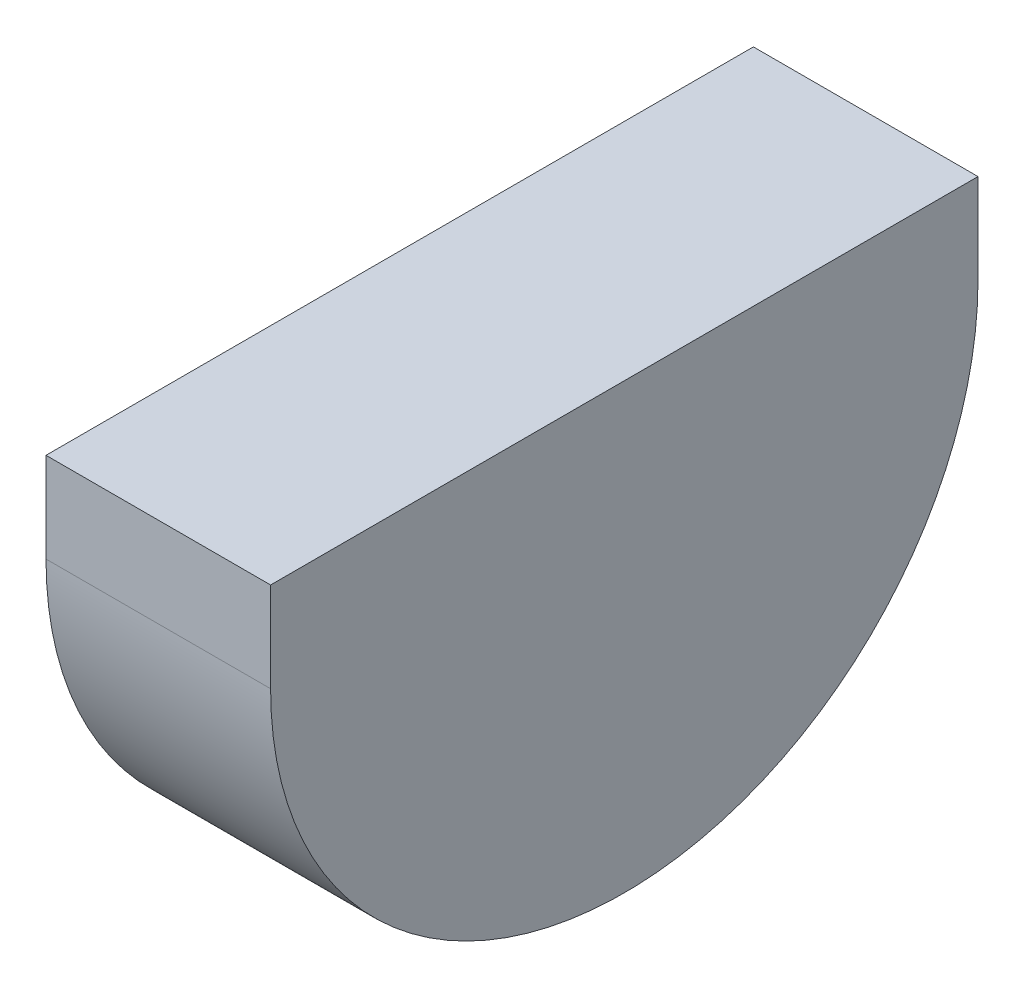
ISO-10303-21;
HEADER;
FILE_DESCRIPTION(('STEP AP214'),'2;1');
FILE_NAME('part.step','',(''),(''),'','','');
FILE_SCHEMA(('AUTOMOTIVE_DESIGN { 1 0 10303 214 1 1 1 1 }'));
ENDSEC;
DATA;
#1=APPLICATION_CONTEXT('core data for automotive mechanical design processes');
#2=APPLICATION_PROTOCOL_DEFINITION('international standard','automotive_design',2000,#1);
#3=PRODUCT_CONTEXT('',#1,'mechanical');
#4=PRODUCT('Part','Part','',(#3));
#5=PRODUCT_RELATED_PRODUCT_CATEGORY('part','',(#4));
#6=PRODUCT_DEFINITION_FORMATION('','',#4);
#7=PRODUCT_DEFINITION_CONTEXT('part definition',#1,'design');
#8=PRODUCT_DEFINITION('design','',#6,#7);
#9=PRODUCT_DEFINITION_SHAPE('','',#8);
#10=(LENGTH_UNIT() NAMED_UNIT(*) SI_UNIT(.MILLI.,.METRE.));
#11=(NAMED_UNIT(*) PLANE_ANGLE_UNIT() SI_UNIT($,.RADIAN.));
#12=(NAMED_UNIT(*) SI_UNIT($,.STERADIAN.) SOLID_ANGLE_UNIT());
#13=UNCERTAINTY_MEASURE_WITH_UNIT(LENGTH_MEASURE(1.E-05),#10,'distance_accuracy_value','');
#14=(GEOMETRIC_REPRESENTATION_CONTEXT(3) GLOBAL_UNCERTAINTY_ASSIGNED_CONTEXT((#13)) GLOBAL_UNIT_ASSIGNED_CONTEXT((#10,
#11,#12)) REPRESENTATION_CONTEXT('',''));
#15=CARTESIAN_POINT('',(0.,0.,0.));
#16=DIRECTION('',(0.,0.,1.));
#17=DIRECTION('',(1.,0.,0.));
#18=AXIS2_PLACEMENT_3D('',#15,#16,#17);
#19=CARTESIAN_POINT('',(1.5875,7.112,24.1046));
#20=DIRECTION('',(-1.,0.,0.));
#21=DIRECTION('',(0.,0.,1.));
#22=AXIS2_PLACEMENT_3D('',#19,#20,#21);
#23=CYLINDRICAL_SURFACE('',#22,5.);
#24=CARTESIAN_POINT('',(-1.5875,7.112,24.1046));
#25=DIRECTION('',(1.,0.,0.));
#26=DIRECTION('',(0.,0.,1.));
#27=AXIS2_PLACEMENT_3D('',#24,#25,#26);
#28=CIRCLE('',#27,5.);
#29=CARTESIAN_POINT('',(-1.5875,7.112,29.1046));
#30=VERTEX_POINT('',#29);
#31=CARTESIAN_POINT('',(-1.5875,7.112,19.1046));
#32=VERTEX_POINT('',#31);
#33=EDGE_CURVE('E71',#30,#32,#28,.T.);
#34=ORIENTED_EDGE('',*,*,#33,.T.);
#35=DIRECTION('',(-1.,0.,0.));
#36=VECTOR('',#35,1.);
#37=CARTESIAN_POINT('',(1.5875,7.112,19.1046));
#38=LINE('',#37,#36);
#39=CARTESIAN_POINT('',(1.5875,7.112,19.1046));
#40=VERTEX_POINT('',#39);
#41=EDGE_CURVE('E11',#40,#32,#38,.T.);
#42=ORIENTED_EDGE('',*,*,#41,.F.);
#43=CARTESIAN_POINT('',(1.5875,7.112,24.1046));
#44=DIRECTION('',(1.,0.,0.));
#45=DIRECTION('',(0.,0.,1.));
#46=AXIS2_PLACEMENT_3D('',#43,#44,#45);
#47=CIRCLE('',#46,5.);
#48=CARTESIAN_POINT('',(1.5875,7.112,29.1046));
#49=VERTEX_POINT('',#48);
#50=EDGE_CURVE('E45',#49,#40,#47,.T.);
#51=ORIENTED_EDGE('',*,*,#50,.F.);
#52=DIRECTION('',(-1.,0.,0.));
#53=VECTOR('',#52,1.);
#54=CARTESIAN_POINT('',(1.5875,7.112,29.1046));
#55=LINE('',#54,#53);
#56=EDGE_CURVE('E38',#49,#30,#55,.T.);
#57=ORIENTED_EDGE('',*,*,#56,.T.);
#58=EDGE_LOOP('',(#34,#42,#51,#57));
#59=FACE_BOUND('',#58,.T.);
#60=ADVANCED_FACE('F31',(#59),#23,.T.);
#61=CARTESIAN_POINT('',(1.5875,7.112,24.1046));
#62=DIRECTION('',(-1.,0.,0.));
#63=DIRECTION('',(0.,0.,1.));
#64=AXIS2_PLACEMENT_3D('',#61,#62,#63);
#65=PLANE('',#64);
#66=ORIENTED_EDGE('',*,*,#50,.T.);
#67=DIRECTION('',(0.,-1.,0.));
#68=VECTOR('',#67,1.);
#69=CARTESIAN_POINT('',(1.5875,8.382,19.1046));
#70=LINE('',#69,#68);
#71=CARTESIAN_POINT('',(1.5875,8.382,19.1046));
#72=VERTEX_POINT('',#71);
#73=EDGE_CURVE('E86',#72,#40,#70,.T.);
#74=ORIENTED_EDGE('',*,*,#73,.F.);
#75=DIRECTION('',(0.,0.,-1.));
#76=VECTOR('',#75,1.);
#77=CARTESIAN_POINT('',(1.5875,8.382,29.1046));
#78=LINE('',#77,#76);
#79=CARTESIAN_POINT('',(1.5875,8.382,29.1046));
#80=VERTEX_POINT('',#79);
#81=EDGE_CURVE('E92',#80,#72,#78,.T.);
#82=ORIENTED_EDGE('',*,*,#81,.F.);
#83=DIRECTION('',(0.,-1.,0.));
#84=VECTOR('',#83,1.);
#85=CARTESIAN_POINT('',(1.5875,8.382,29.1046));
#86=LINE('',#85,#84);
#87=EDGE_CURVE('E83',#80,#49,#86,.T.);
#88=ORIENTED_EDGE('',*,*,#87,.T.);
#89=EDGE_LOOP('',(#66,#74,#82,#88));
#90=FACE_BOUND('',#89,.T.);
#91=ADVANCED_FACE('F105',(#90),#65,.F.);
#92=CARTESIAN_POINT('',(-1.5875,7.112,24.1046));
#93=DIRECTION('',(-1.,0.,0.));
#94=DIRECTION('',(0.,0.,1.));
#95=AXIS2_PLACEMENT_3D('',#92,#93,#94);
#96=PLANE('',#95);
#97=ORIENTED_EDGE('',*,*,#33,.F.);
#98=DIRECTION('',(0.,-1.,0.));
#99=VECTOR('',#98,1.);
#100=CARTESIAN_POINT('',(-1.5875,8.382,29.1046));
#101=LINE('',#100,#99);
#102=CARTESIAN_POINT('',(-1.5875,8.382,29.1046));
#103=VERTEX_POINT('',#102);
#104=EDGE_CURVE('E74',#103,#30,#101,.T.);
#105=ORIENTED_EDGE('',*,*,#104,.F.);
#106=DIRECTION('',(0.,0.,1.));
#107=VECTOR('',#106,1.);
#108=CARTESIAN_POINT('',(-1.5875,8.382,19.1046));
#109=LINE('',#108,#107);
#110=CARTESIAN_POINT('',(-1.5875,8.382,19.1046));
#111=VERTEX_POINT('',#110);
#112=EDGE_CURVE('E95',#111,#103,#109,.T.);
#113=ORIENTED_EDGE('',*,*,#112,.F.);
#114=DIRECTION('',(0.,-1.,0.));
#115=VECTOR('',#114,1.);
#116=CARTESIAN_POINT('',(-1.5875,8.382,19.1046));
#117=LINE('',#116,#115);
#118=EDGE_CURVE('E77',#111,#32,#117,.T.);
#119=ORIENTED_EDGE('',*,*,#118,.T.);
#120=EDGE_LOOP('',(#97,#105,#113,#119));
#121=FACE_BOUND('',#120,.T.);
#122=ADVANCED_FACE('F72',(#121),#96,.T.);
#123=CARTESIAN_POINT('',(1.5875,8.382,19.1046));
#124=DIRECTION('',(0.,0.,1.));
#125=DIRECTION('',(1.,0.,0.));
#126=AXIS2_PLACEMENT_3D('',#123,#124,#125);
#127=PLANE('',#126);
#128=ORIENTED_EDGE('',*,*,#41,.T.);
#129=ORIENTED_EDGE('',*,*,#118,.F.);
#130=DIRECTION('',(-1.,0.,0.));
#131=VECTOR('',#130,1.);
#132=CARTESIAN_POINT('',(1.5875,8.382,19.1046));
#133=LINE('',#132,#131);
#134=EDGE_CURVE('E97',#72,#111,#133,.T.);
#135=ORIENTED_EDGE('',*,*,#134,.F.);
#136=ORIENTED_EDGE('',*,*,#73,.T.);
#137=EDGE_LOOP('',(#128,#129,#135,#136));
#138=FACE_BOUND('',#137,.T.);
#139=ADVANCED_FACE('F104',(#138),#127,.F.);
#140=CARTESIAN_POINT('',(-1.5875,8.382,29.1046));
#141=DIRECTION('',(0.,0.,-1.));
#142=DIRECTION('',(-1.,0.,0.));
#143=AXIS2_PLACEMENT_3D('',#140,#141,#142);
#144=PLANE('',#143);
#145=ORIENTED_EDGE('',*,*,#56,.F.);
#146=ORIENTED_EDGE('',*,*,#87,.F.);
#147=DIRECTION('',(1.,0.,0.));
#148=VECTOR('',#147,1.);
#149=CARTESIAN_POINT('',(-1.5875,8.382,29.1046));
#150=LINE('',#149,#148);
#151=EDGE_CURVE('E82',#103,#80,#150,.T.);
#152=ORIENTED_EDGE('',*,*,#151,.F.);
#153=ORIENTED_EDGE('',*,*,#104,.T.);
#154=EDGE_LOOP('',(#145,#146,#152,#153));
#155=FACE_BOUND('',#154,.T.);
#156=ADVANCED_FACE('F81',(#155),#144,.F.);
#157=CARTESIAN_POINT('',(-1.5875,8.382,19.1046));
#158=DIRECTION('',(0.,1.,0.));
#159=DIRECTION('',(0.,0.,1.));
#160=AXIS2_PLACEMENT_3D('',#157,#158,#159);
#161=PLANE('',#160);
#162=ORIENTED_EDGE('',*,*,#134,.T.);
#163=ORIENTED_EDGE('',*,*,#112,.T.);
#164=ORIENTED_EDGE('',*,*,#151,.T.);
#165=ORIENTED_EDGE('',*,*,#81,.T.);
#166=EDGE_LOOP('',(#162,#163,#164,#165));
#167=FACE_BOUND('',#166,.T.);
#168=ADVANCED_FACE('F101',(#167),#161,.T.);
#169=CLOSED_SHELL('',(#60,#91,#122,#139,#156,#168));
#170=MANIFOLD_SOLID_BREP('B2',#169);
#171=ADVANCED_BREP_SHAPE_REPRESENTATION('',(#18,#170),#14);
#172=SHAPE_DEFINITION_REPRESENTATION(#9,#171);
ENDSEC;
END-ISO-10303-21;
